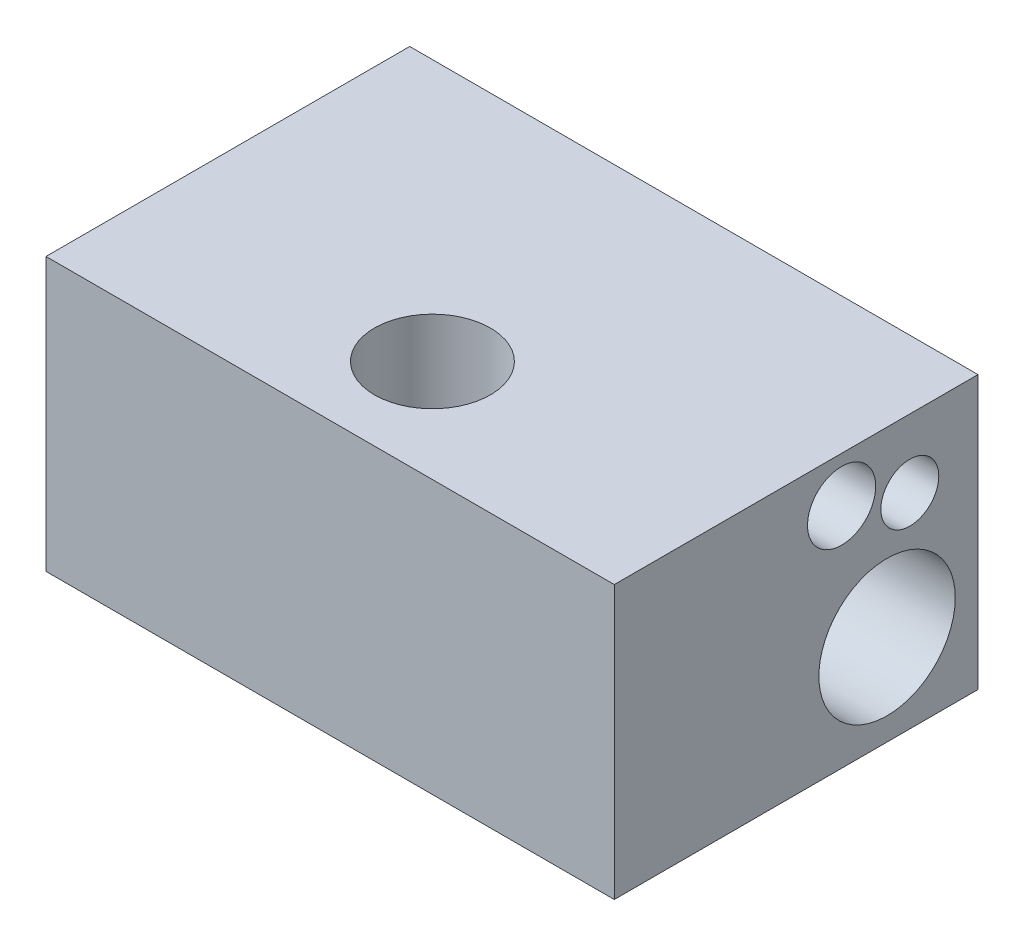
ISO-10303-21;
HEADER;
FILE_DESCRIPTION(('STEP AP214'),'2;1');
FILE_NAME('part.step','',(''),(''),'','','');
FILE_SCHEMA(('AUTOMOTIVE_DESIGN { 1 0 10303 214 1 1 1 1 }'));
ENDSEC;
DATA;
#1=APPLICATION_CONTEXT('core data for automotive mechanical design processes');
#2=APPLICATION_PROTOCOL_DEFINITION('international standard','automotive_design',2000,#1);
#3=PRODUCT_CONTEXT('',#1,'mechanical');
#4=PRODUCT('Part','Part','',(#3));
#5=PRODUCT_RELATED_PRODUCT_CATEGORY('part','',(#4));
#6=PRODUCT_DEFINITION_FORMATION('','',#4);
#7=PRODUCT_DEFINITION_CONTEXT('part definition',#1,'design');
#8=PRODUCT_DEFINITION('design','',#6,#7);
#9=PRODUCT_DEFINITION_SHAPE('','',#8);
#10=(LENGTH_UNIT() NAMED_UNIT(*) SI_UNIT(.MILLI.,.METRE.));
#11=(NAMED_UNIT(*) PLANE_ANGLE_UNIT() SI_UNIT($,.RADIAN.));
#12=(NAMED_UNIT(*) SI_UNIT($,.STERADIAN.) SOLID_ANGLE_UNIT());
#13=UNCERTAINTY_MEASURE_WITH_UNIT(LENGTH_MEASURE(1.E-05),#10,'distance_accuracy_value','');
#14=(GEOMETRIC_REPRESENTATION_CONTEXT(3) GLOBAL_UNCERTAINTY_ASSIGNED_CONTEXT((#13)) GLOBAL_UNIT_ASSIGNED_CONTEXT((#10,
#11,#12)) REPRESENTATION_CONTEXT('',''));
#15=CARTESIAN_POINT('',(0.,0.,0.));
#16=DIRECTION('',(0.,0.,1.));
#17=DIRECTION('',(1.,0.,0.));
#18=AXIS2_PLACEMENT_3D('',#15,#16,#17);
#19=CARTESIAN_POINT('',(0.,6.,3.5));
#20=DIRECTION('',(0.,-1.,0.));
#21=DIRECTION('',(0.,0.,-1.));
#22=AXIS2_PLACEMENT_3D('',#19,#20,#21);
#23=CYLINDRICAL_SURFACE('',#22,3.);
#24=CARTESIAN_POINT('',(0.,-6.,3.5));
#25=DIRECTION('',(0.,-1.,0.));
#26=DIRECTION('',(0.,0.,-1.));
#27=AXIS2_PLACEMENT_3D('',#24,#25,#26);
#28=CIRCLE('',#27,3.);
#29=CARTESIAN_POINT('',(0.,-6.,0.5));
#30=VERTEX_POINT('',#29);
#31=EDGE_CURVE('P0_E16',#30,#30,#28,.F.);
#32=ORIENTED_EDGE('',*,*,#31,.T.);
#33=EDGE_LOOP('',(#32));
#34=FACE_BOUND('',#33,.T.);
#35=CARTESIAN_POINT('',(0.,6.,3.5));
#36=DIRECTION('',(0.,-1.,0.));
#37=DIRECTION('',(0.,0.,-1.));
#38=AXIS2_PLACEMENT_3D('',#35,#36,#37);
#39=CIRCLE('',#38,3.);
#40=CARTESIAN_POINT('',(0.,6.,0.5));
#41=VERTEX_POINT('',#40);
#42=EDGE_CURVE('P0_E10',#41,#41,#39,.T.);
#43=ORIENTED_EDGE('',*,*,#42,.T.);
#44=EDGE_LOOP('',(#43));
#45=FACE_BOUND('',#44,.T.);
#46=ADVANCED_FACE('P0_F15',(#34,#45),#23,.T.);
#47=OPEN_SHELL('',(#46));
#48=SHELL_BASED_SURFACE_MODEL('P0_B1',(#47));
#49=CARTESIAN_POINT('',(-6.63397459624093,4.,-2.));
#50=DIRECTION('',(1.,0.,0.));
#51=DIRECTION('',(0.,0.,-1.));
#52=AXIS2_PLACEMENT_3D('',#49,#50,#51);
#53=CONICAL_SURFACE('',#52,1.49999999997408,1.04719755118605);
#54=CARTESIAN_POINT('',(-7.5000000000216,4.,-1.99999999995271));
#55=VERTEX_POINT('',#54);
#56=VERTEX_LOOP('',#55);
#57=FACE_BOUND('',#56,.T.);
#58=CARTESIAN_POINT('',(-6.633974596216,4.,-2.));
#59=DIRECTION('',(1.,0.,0.));
#60=DIRECTION('',(0.,0.,-1.));
#61=AXIS2_PLACEMENT_3D('',#58,#59,#60);
#62=CIRCLE('',#61,1.5);
#63=CARTESIAN_POINT('',(-6.633974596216,4.,-3.5));
#64=VERTEX_POINT('',#63);
#65=EDGE_CURVE('P1_E78',#64,#64,#62,.T.);
#66=ORIENTED_EDGE('',*,*,#65,.T.);
#67=EDGE_LOOP('',(#66));
#68=FACE_BOUND('',#67,.T.);
#69=ADVANCED_FACE('P1_F17',(#57,#68),#53,.F.);
#70=CARTESIAN_POINT('',(1.23612159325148,3.,-5.));
#71=DIRECTION('',(1.,0.,0.));
#72=DIRECTION('',(0.,0.,-1.));
#73=AXIS2_PLACEMENT_3D('',#70,#71,#72);
#74=CONICAL_SURFACE('',#73,1.27500000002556,1.04719755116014);
#75=CARTESIAN_POINT('',(0.500000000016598,3.,-5.00000000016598));
#76=VERTEX_POINT('',#75);
#77=VERTEX_LOOP('',#76);
#78=FACE_BOUND('',#77,.T.);
#79=CARTESIAN_POINT('',(1.236121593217,3.,-5.));
#80=DIRECTION('',(1.,0.,0.));
#81=DIRECTION('',(0.,0.,-1.));
#82=AXIS2_PLACEMENT_3D('',#79,#80,#81);
#83=CIRCLE('',#82,1.275);
#84=CARTESIAN_POINT('',(1.236121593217,3.,-6.275));
#85=VERTEX_POINT('',#84);
#86=EDGE_CURVE('P1_E81',#85,#85,#83,.T.);
#87=ORIENTED_EDGE('',*,*,#86,.T.);
#88=EDGE_LOOP('',(#87));
#89=FACE_BOUND('',#88,.T.);
#90=ADVANCED_FACE('P1_F75',(#78,#89),#74,.F.);
#91=CARTESIAN_POINT('',(12.5,-2.,-4.));
#92=DIRECTION('',(1.,0.,0.));
#93=DIRECTION('',(0.,0.,-1.));
#94=AXIS2_PLACEMENT_3D('',#91,#92,#93);
#95=CYLINDRICAL_SURFACE('',#94,3.);
#96=CARTESIAN_POINT('',(-12.5,-2.,-4.));
#97=DIRECTION('',(1.,0.,0.));
#98=DIRECTION('',(0.,0.,-1.));
#99=AXIS2_PLACEMENT_3D('',#96,#97,#98);
#100=CIRCLE('',#99,3.);
#101=CARTESIAN_POINT('',(-12.5,-2.,-7.));
#102=VERTEX_POINT('',#101);
#103=EDGE_CURVE('P1_E20',#102,#102,#100,.T.);
#104=ORIENTED_EDGE('',*,*,#103,.F.);
#105=EDGE_LOOP('',(#104));
#106=FACE_BOUND('',#105,.T.);
#107=CARTESIAN_POINT('',(12.5,-2.,-4.));
#108=DIRECTION('',(1.,0.,0.));
#109=DIRECTION('',(0.,0.,-1.));
#110=AXIS2_PLACEMENT_3D('',#107,#108,#109);
#111=CIRCLE('',#110,3.);
#112=CARTESIAN_POINT('',(12.5,-2.,-7.));
#113=VERTEX_POINT('',#112);
#114=EDGE_CURVE('P1_E104',#113,#113,#111,.F.);
#115=ORIENTED_EDGE('',*,*,#114,.F.);
#116=EDGE_LOOP('',(#115));
#117=FACE_BOUND('',#116,.T.);
#118=ADVANCED_FACE('P1_F143',(#106,#117),#95,.F.);
#119=CARTESIAN_POINT('',(12.5,4.,-2.));
#120=DIRECTION('',(1.,0.,0.));
#121=DIRECTION('',(0.,0.,-1.));
#122=AXIS2_PLACEMENT_3D('',#119,#120,#121);
#123=CYLINDRICAL_SURFACE('',#122,1.5);
#124=CARTESIAN_POINT('',(12.5,4.,-2.));
#125=DIRECTION('',(1.,0.,0.));
#126=DIRECTION('',(0.,0.,-1.));
#127=AXIS2_PLACEMENT_3D('',#124,#125,#126);
#128=CIRCLE('',#127,1.5);
#129=CARTESIAN_POINT('',(12.5,4.,-3.5));
#130=VERTEX_POINT('',#129);
#131=EDGE_CURVE('P1_E101',#130,#130,#128,.F.);
#132=ORIENTED_EDGE('',*,*,#131,.F.);
#133=EDGE_LOOP('',(#132));
#134=FACE_BOUND('',#133,.T.);
#135=ORIENTED_EDGE('',*,*,#65,.F.);
#136=EDGE_LOOP('',(#135));
#137=FACE_BOUND('',#136,.T.);
#138=ADVANCED_FACE('P1_F146',(#134,#137),#123,.F.);
#139=CARTESIAN_POINT('',(12.5,3.,-5.));
#140=DIRECTION('',(1.,0.,0.));
#141=DIRECTION('',(0.,0.,-1.));
#142=AXIS2_PLACEMENT_3D('',#139,#140,#141);
#143=CYLINDRICAL_SURFACE('',#142,1.275);
#144=CARTESIAN_POINT('',(12.5,3.,-5.));
#145=DIRECTION('',(1.,0.,0.));
#146=DIRECTION('',(0.,0.,-1.));
#147=AXIS2_PLACEMENT_3D('',#144,#145,#146);
#148=CIRCLE('',#147,1.275);
#149=CARTESIAN_POINT('',(12.5,3.,-6.275));
#150=VERTEX_POINT('',#149);
#151=EDGE_CURVE('P1_E96',#150,#150,#148,.F.);
#152=ORIENTED_EDGE('',*,*,#151,.F.);
#153=EDGE_LOOP('',(#152));
#154=FACE_BOUND('',#153,.T.);
#155=ORIENTED_EDGE('',*,*,#86,.F.);
#156=EDGE_LOOP('',(#155));
#157=FACE_BOUND('',#156,.T.);
#158=ADVANCED_FACE('P1_F153',(#154,#157),#143,.F.);
#159=CARTESIAN_POINT('',(0.,6.,0.));
#160=DIRECTION('',(0.,1.,0.));
#161=DIRECTION('',(0.,0.,1.));
#162=AXIS2_PLACEMENT_3D('',#159,#160,#161);
#163=PLANE('',#162);
#164=CARTESIAN_POINT('',(0.,6.,3.5));
#165=DIRECTION('',(0.,1.,0.));
#166=DIRECTION('',(0.,0.,1.));
#167=AXIS2_PLACEMENT_3D('',#164,#165,#166);
#168=CIRCLE('',#167,2.55);
#169=CARTESIAN_POINT('',(0.,6.,6.05));
#170=VERTEX_POINT('',#169);
#171=EDGE_CURVE('P1_E91',#170,#170,#168,.F.);
#172=ORIENTED_EDGE('',*,*,#171,.T.);
#173=EDGE_LOOP('',(#172));
#174=FACE_BOUND('',#173,.T.);
#175=DIRECTION('',(-1.,0.,0.));
#176=VECTOR('',#175,1.);
#177=CARTESIAN_POINT('',(12.5,6.,-8.));
#178=LINE('',#177,#176);
#179=CARTESIAN_POINT('',(-12.5,6.,-8.));
#180=VERTEX_POINT('',#179);
#181=CARTESIAN_POINT('',(12.5,6.,-8.));
#182=VERTEX_POINT('',#181);
#183=EDGE_CURVE('P1_E255',#180,#182,#178,.F.);
#184=ORIENTED_EDGE('',*,*,#183,.F.);
#185=DIRECTION('',(0.,0.,1.));
#186=VECTOR('',#185,1.);
#187=CARTESIAN_POINT('',(-12.5,6.,-8.));
#188=LINE('',#187,#186);
#189=CARTESIAN_POINT('',(-12.5,6.,8.));
#190=VERTEX_POINT('',#189);
#191=EDGE_CURVE('P1_E87',#190,#180,#188,.F.);
#192=ORIENTED_EDGE('',*,*,#191,.F.);
#193=DIRECTION('',(1.,0.,0.));
#194=VECTOR('',#193,1.);
#195=CARTESIAN_POINT('',(-12.5,6.,8.));
#196=LINE('',#195,#194);
#197=CARTESIAN_POINT('',(12.5,6.,8.));
#198=VERTEX_POINT('',#197);
#199=EDGE_CURVE('P1_E126',#198,#190,#196,.F.);
#200=ORIENTED_EDGE('',*,*,#199,.F.);
#201=DIRECTION('',(0.,0.,-1.));
#202=VECTOR('',#201,1.);
#203=CARTESIAN_POINT('',(12.5,6.,8.));
#204=LINE('',#203,#202);
#205=EDGE_CURVE('P1_E111',#182,#198,#204,.F.);
#206=ORIENTED_EDGE('',*,*,#205,.F.);
#207=EDGE_LOOP('',(#184,#192,#200,#206));
#208=FACE_BOUND('',#207,.T.);
#209=ADVANCED_FACE('P1_F180',(#174,#208),#163,.T.);
#210=CARTESIAN_POINT('',(-12.5,-6.,-8.));
#211=DIRECTION('',(-1.,0.,0.));
#212=DIRECTION('',(0.,0.,1.));
#213=AXIS2_PLACEMENT_3D('',#210,#211,#212);
#214=PLANE('',#213);
#215=ORIENTED_EDGE('',*,*,#103,.T.);
#216=EDGE_LOOP('',(#215));
#217=FACE_BOUND('',#216,.T.);
#218=DIRECTION('',(0.,1.,0.));
#219=VECTOR('',#218,1.);
#220=CARTESIAN_POINT('',(-12.5,-6.,-8.));
#221=LINE('',#220,#219);
#222=CARTESIAN_POINT('',(-12.5,-6.,-8.));
#223=VERTEX_POINT('',#222);
#224=EDGE_CURVE('P1_E100',#223,#180,#221,.T.);
#225=ORIENTED_EDGE('',*,*,#224,.F.);
#226=DIRECTION('',(0.,0.,1.));
#227=VECTOR('',#226,1.);
#228=CARTESIAN_POINT('',(-12.5,-6.,0.));
#229=LINE('',#228,#227);
#230=CARTESIAN_POINT('',(-12.5,-6.,8.));
#231=VERTEX_POINT('',#230);
#232=EDGE_CURVE('P1_E95',#223,#231,#229,.T.);
#233=ORIENTED_EDGE('',*,*,#232,.T.);
#234=DIRECTION('',(0.,1.,0.));
#235=VECTOR('',#234,1.);
#236=CARTESIAN_POINT('',(-12.5,-6.,8.));
#237=LINE('',#236,#235);
#238=EDGE_CURVE('P1_E119',#190,#231,#237,.F.);
#239=ORIENTED_EDGE('',*,*,#238,.F.);
#240=ORIENTED_EDGE('',*,*,#191,.T.);
#241=EDGE_LOOP('',(#225,#233,#239,#240));
#242=FACE_BOUND('',#241,.T.);
#243=ADVANCED_FACE('P1_F141',(#217,#242),#214,.T.);
#244=CARTESIAN_POINT('',(-12.5,-6.,8.));
#245=DIRECTION('',(0.,0.,1.));
#246=DIRECTION('',(1.,0.,0.));
#247=AXIS2_PLACEMENT_3D('',#244,#245,#246);
#248=PLANE('',#247);
#249=ORIENTED_EDGE('',*,*,#238,.T.);
#250=DIRECTION('',(1.,0.,0.));
#251=VECTOR('',#250,1.);
#252=CARTESIAN_POINT('',(0.,-6.,8.));
#253=LINE('',#252,#251);
#254=CARTESIAN_POINT('',(12.5,-6.,8.));
#255=VERTEX_POINT('',#254);
#256=EDGE_CURVE('P1_E262',#231,#255,#253,.T.);
#257=ORIENTED_EDGE('',*,*,#256,.T.);
#258=DIRECTION('',(0.,1.,0.));
#259=VECTOR('',#258,1.);
#260=CARTESIAN_POINT('',(12.5,-6.,8.));
#261=LINE('',#260,#259);
#262=EDGE_CURVE('P1_E107',#198,#255,#261,.F.);
#263=ORIENTED_EDGE('',*,*,#262,.F.);
#264=ORIENTED_EDGE('',*,*,#199,.T.);
#265=EDGE_LOOP('',(#249,#257,#263,#264));
#266=FACE_BOUND('',#265,.T.);
#267=ADVANCED_FACE('P1_F173',(#266),#248,.T.);
#268=CARTESIAN_POINT('',(12.5,-6.,8.));
#269=DIRECTION('',(1.,0.,0.));
#270=DIRECTION('',(0.,0.,-1.));
#271=AXIS2_PLACEMENT_3D('',#268,#269,#270);
#272=PLANE('',#271);
#273=ORIENTED_EDGE('',*,*,#151,.T.);
#274=EDGE_LOOP('',(#273));
#275=FACE_BOUND('',#274,.T.);
#276=ORIENTED_EDGE('',*,*,#131,.T.);
#277=EDGE_LOOP('',(#276));
#278=FACE_BOUND('',#277,.T.);
#279=ORIENTED_EDGE('',*,*,#114,.T.);
#280=EDGE_LOOP('',(#279));
#281=FACE_BOUND('',#280,.T.);
#282=ORIENTED_EDGE('',*,*,#262,.T.);
#283=DIRECTION('',(0.,0.,1.));
#284=VECTOR('',#283,1.);
#285=CARTESIAN_POINT('',(12.5,-6.,0.));
#286=LINE('',#285,#284);
#287=CARTESIAN_POINT('',(12.5,-6.,-8.));
#288=VERTEX_POINT('',#287);
#289=EDGE_CURVE('P1_E266',#255,#288,#286,.F.);
#290=ORIENTED_EDGE('',*,*,#289,.T.);
#291=DIRECTION('',(0.,1.,0.));
#292=VECTOR('',#291,1.);
#293=CARTESIAN_POINT('',(12.5,-6.,-8.));
#294=LINE('',#293,#292);
#295=EDGE_CURVE('P1_E40',#182,#288,#294,.F.);
#296=ORIENTED_EDGE('',*,*,#295,.F.);
#297=ORIENTED_EDGE('',*,*,#205,.T.);
#298=EDGE_LOOP('',(#282,#290,#296,#297));
#299=FACE_BOUND('',#298,.T.);
#300=ADVANCED_FACE('P1_F170',(#275,#278,#281,#299),#272,.T.);
#301=CARTESIAN_POINT('',(12.5,-6.,-8.));
#302=DIRECTION('',(0.,0.,-1.));
#303=DIRECTION('',(-1.,0.,0.));
#304=AXIS2_PLACEMENT_3D('',#301,#302,#303);
#305=PLANE('',#304);
#306=ORIENTED_EDGE('',*,*,#295,.T.);
#307=DIRECTION('',(1.,0.,0.));
#308=VECTOR('',#307,1.);
#309=CARTESIAN_POINT('',(0.,-6.,-8.));
#310=LINE('',#309,#308);
#311=EDGE_CURVE('P1_E27',#288,#223,#310,.F.);
#312=ORIENTED_EDGE('',*,*,#311,.T.);
#313=ORIENTED_EDGE('',*,*,#224,.T.);
#314=ORIENTED_EDGE('',*,*,#183,.T.);
#315=EDGE_LOOP('',(#306,#312,#313,#314));
#316=FACE_BOUND('',#315,.T.);
#317=ADVANCED_FACE('P1_F163',(#316),#305,.T.);
#318=CARTESIAN_POINT('',(0.,-6.,3.5));
#319=DIRECTION('',(0.,1.,0.));
#320=DIRECTION('',(0.,0.,1.));
#321=AXIS2_PLACEMENT_3D('',#318,#319,#320);
#322=CYLINDRICAL_SURFACE('',#321,2.55);
#323=ORIENTED_EDGE('',*,*,#171,.F.);
#324=EDGE_LOOP('',(#323));
#325=FACE_BOUND('',#324,.T.);
#326=CARTESIAN_POINT('',(0.,-6.,3.5));
#327=DIRECTION('',(0.,1.,0.));
#328=DIRECTION('',(0.,0.,1.));
#329=AXIS2_PLACEMENT_3D('',#326,#327,#328);
#330=CIRCLE('',#329,2.55);
#331=CARTESIAN_POINT('',(0.,-6.,6.05));
#332=VERTEX_POINT('',#331);
#333=EDGE_CURVE('P1_E11',#332,#332,#330,.F.);
#334=ORIENTED_EDGE('',*,*,#333,.T.);
#335=EDGE_LOOP('',(#334));
#336=FACE_BOUND('',#335,.T.);
#337=ADVANCED_FACE('P1_F158',(#325,#336),#322,.F.);
#338=CARTESIAN_POINT('',(0.,-6.,0.));
#339=DIRECTION('',(0.,1.,0.));
#340=DIRECTION('',(0.,0.,1.));
#341=AXIS2_PLACEMENT_3D('',#338,#339,#340);
#342=PLANE('',#341);
#343=ORIENTED_EDGE('',*,*,#333,.F.);
#344=EDGE_LOOP('',(#343));
#345=FACE_BOUND('',#344,.T.);
#346=ORIENTED_EDGE('',*,*,#289,.F.);
#347=ORIENTED_EDGE('',*,*,#256,.F.);
#348=ORIENTED_EDGE('',*,*,#232,.F.);
#349=ORIENTED_EDGE('',*,*,#311,.F.);
#350=EDGE_LOOP('',(#346,#347,#348,#349));
#351=FACE_BOUND('',#350,.T.);
#352=ADVANCED_FACE('P1_F157',(#345,#351),#342,.F.);
#353=CLOSED_SHELL('',(#69,#90,#118,#138,#158,#209,#243,#267,#300,#317,#337,#352));
#354=MANIFOLD_SOLID_BREP('P1_B1',#353);
#355=CARTESIAN_POINT('',(12.5,3.,-5.));
#356=DIRECTION('',(1.,0.,0.));
#357=DIRECTION('',(0.,0.,-1.));
#358=AXIS2_PLACEMENT_3D('',#355,#356,#357);
#359=CYLINDRICAL_SURFACE('',#358,1.5);
#360=CARTESIAN_POINT('',(2.5,3.,-5.));
#361=DIRECTION('',(1.,0.,0.));
#362=DIRECTION('',(0.,0.,-1.));
#363=AXIS2_PLACEMENT_3D('',#360,#361,#362);
#364=CIRCLE('',#363,1.5);
#365=CARTESIAN_POINT('',(2.5,3.,-6.5));
#366=VERTEX_POINT('',#365);
#367=EDGE_CURVE('P2_E21',#366,#366,#364,.T.);
#368=ORIENTED_EDGE('',*,*,#367,.T.);
#369=EDGE_LOOP('',(#368));
#370=FACE_BOUND('',#369,.T.);
#371=CARTESIAN_POINT('',(12.5,3.,-5.));
#372=DIRECTION('',(1.,0.,0.));
#373=DIRECTION('',(0.,0.,-1.));
#374=AXIS2_PLACEMENT_3D('',#371,#372,#373);
#375=CIRCLE('',#374,1.5);
#376=CARTESIAN_POINT('',(12.5,3.,-6.5));
#377=VERTEX_POINT('',#376);
#378=EDGE_CURVE('P2_E11',#377,#377,#375,.F.);
#379=ORIENTED_EDGE('',*,*,#378,.T.);
#380=EDGE_LOOP('',(#379));
#381=FACE_BOUND('',#380,.T.);
#382=ADVANCED_FACE('P2_F17',(#370,#381),#359,.T.);
#383=CARTESIAN_POINT('',(2.5,3.,-5.));
#384=DIRECTION('',(1.,0.,0.));
#385=DIRECTION('',(0.,0.,-1.));
#386=AXIS2_PLACEMENT_3D('',#383,#384,#385);
#387=PLANE('',#386);
#388=CARTESIAN_POINT('',(2.5,1.725,-5.));
#389=CARTESIAN_POINT('',(2.5,1.72520255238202,-4.75655751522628));
#390=CARTESIAN_POINT('',(2.5,1.8145199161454,-4.53067924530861));
#391=CARTESIAN_POINT('',(2.5,1.91142588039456,-4.28560985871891));
#392=CARTESIAN_POINT('',(2.5,2.09843885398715,-4.09843885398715));
#393=CARTESIAN_POINT('',(2.5,2.28470695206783,-3.91201335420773));
#394=CARTESIAN_POINT('',(2.5,2.53067924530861,-3.8145199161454));
#395=CARTESIAN_POINT('',(2.5,2.75627883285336,-3.72510139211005));
#396=CARTESIAN_POINT('',(2.5,3.,-3.725));
#397=CARTESIAN_POINT('',(2.5,3.24267492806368,-3.72489904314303));
#398=CARTESIAN_POINT('',(2.5,3.46932075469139,-3.8145199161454));
#399=CARTESIAN_POINT('',(2.5,3.71439014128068,-3.91142588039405));
#400=CARTESIAN_POINT('',(2.5,3.90156114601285,-4.09843885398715));
#401=CARTESIAN_POINT('',(2.5,4.08798664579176,-4.28470695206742));
#402=CARTESIAN_POINT('',(2.5,4.1854800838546,-4.53067924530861));
#403=CARTESIAN_POINT('',(2.5,4.27479700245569,-4.75602248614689));
#404=CARTESIAN_POINT('',(2.5,4.275,-5.));
#405=B_SPLINE_CURVE_WITH_KNOTS('',2,(#388,#389,#390,#391,#392,#393,#394,#395,#396,#397,#398,
#399,#400,#401,#402,#403,#404),.UNSPECIFIED.,.F.,.F.,(3,2,2,2,2,2,2,2,3),(0.,0.125,0.25,0.375,
0.5,0.625,0.75,0.875,1.),.UNSPECIFIED.);
#406=CARTESIAN_POINT('',(2.5,1.725,-5.));
#407=VERTEX_POINT('',#406);
#408=CARTESIAN_POINT('',(2.5,4.275,-5.));
#409=VERTEX_POINT('',#408);
#410=EDGE_CURVE('P2_E29',#407,#409,#405,.T.);
#411=ORIENTED_EDGE('',*,*,#410,.F.);
#412=CARTESIAN_POINT('',(2.5,4.275,-5.));
#413=CARTESIAN_POINT('',(2.5,4.27479744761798,-5.24344248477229));
#414=CARTESIAN_POINT('',(2.5,4.1854800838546,-5.46932075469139));
#415=CARTESIAN_POINT('',(2.5,4.08857411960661,-5.71439014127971));
#416=CARTESIAN_POINT('',(2.5,3.90156114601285,-5.90156114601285));
#417=CARTESIAN_POINT('',(2.5,3.71529304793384,-6.08798664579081));
#418=CARTESIAN_POINT('',(2.5,3.46932075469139,-6.1854800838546));
#419=CARTESIAN_POINT('',(2.5,3.24372116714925,-6.27489860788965));
#420=CARTESIAN_POINT('',(2.5,3.,-6.275));
#421=CARTESIAN_POINT('',(2.5,2.75732507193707,-6.27510095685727));
#422=CARTESIAN_POINT('',(2.5,2.53067924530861,-6.1854800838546));
#423=CARTESIAN_POINT('',(2.5,2.28560985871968,-6.0885741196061));
#424=CARTESIAN_POINT('',(2.5,2.09843885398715,-5.90156114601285));
#425=CARTESIAN_POINT('',(2.5,1.91201335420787,-5.71529304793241));
#426=CARTESIAN_POINT('',(2.5,1.8145199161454,-5.46932075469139));
#427=CARTESIAN_POINT('',(2.5,1.72520299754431,-5.24397751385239));
#428=CARTESIAN_POINT('',(2.5,1.725,-5.));
#429=B_SPLINE_CURVE_WITH_KNOTS('',2,(#412,#413,#414,#415,#416,#417,#418,#419,#420,#421,#422,
#423,#424,#425,#426,#427,#428),.UNSPECIFIED.,.F.,.F.,(3,2,2,2,2,2,2,2,3),(0.,0.125,0.25,0.375,
0.5,0.625,0.75,0.875,1.),.UNSPECIFIED.);
#430=EDGE_CURVE('P2_E34',#409,#407,#429,.T.);
#431=ORIENTED_EDGE('',*,*,#430,.F.);
#432=EDGE_LOOP('',(#411,#431));
#433=FACE_BOUND('',#432,.T.);
#434=ORIENTED_EDGE('',*,*,#367,.F.);
#435=EDGE_LOOP('',(#434));
#436=FACE_BOUND('',#435,.T.);
#437=ADVANCED_FACE('P2_F18',(#433,#436),#387,.F.);
#438=OPEN_SHELL('',(#382,#437));
#439=SHELL_BASED_SURFACE_MODEL('P2_B1',(#438));
#440=ADVANCED_BREP_SHAPE_REPRESENTATION('',(#18,#354),#14);
#441=MANIFOLD_SURFACE_SHAPE_REPRESENTATION('',(#18,#48,#439),#14);
#442=SHAPE_REPRESENTATION('',(#18),#14);
#443=SHAPE_DEFINITION_REPRESENTATION(#9,#442);
#444=SHAPE_REPRESENTATION_RELATIONSHIP('','',#442,#440);
#445=SHAPE_REPRESENTATION_RELATIONSHIP('','',#442,#441);
ENDSEC;
END-ISO-10303-21;
